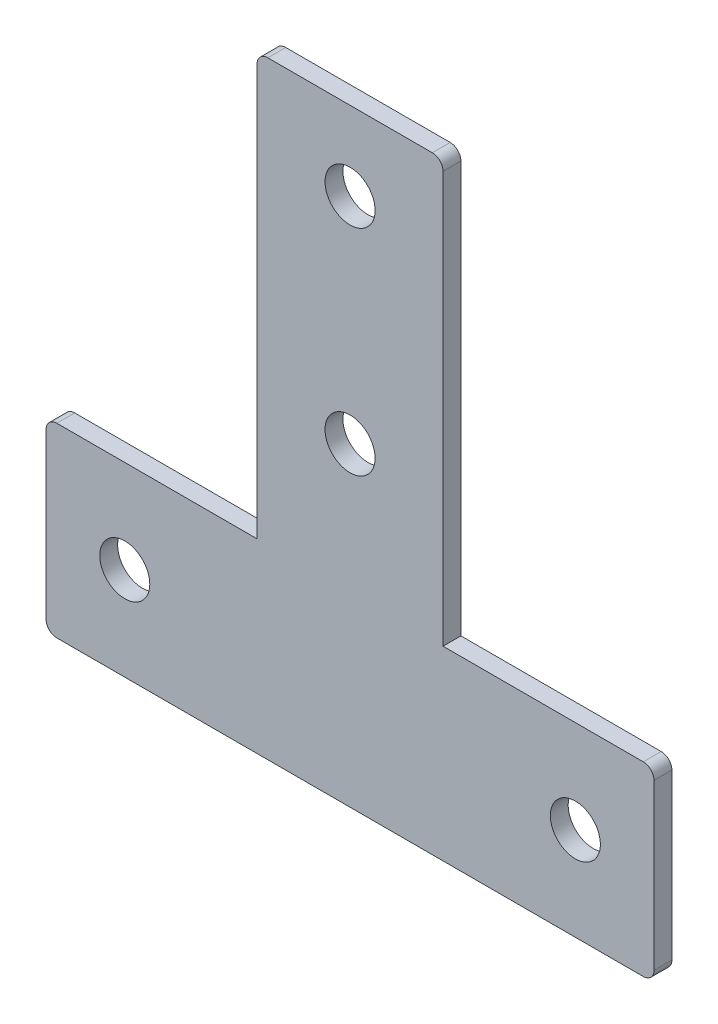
ISO-10303-21;
HEADER;
FILE_DESCRIPTION(('STEP AP214'),'2;1');
FILE_NAME('part.step','',(''),(''),'','','');
FILE_SCHEMA(('AUTOMOTIVE_DESIGN { 1 0 10303 214 1 1 1 1 }'));
ENDSEC;
DATA;
#1=APPLICATION_CONTEXT('core data for automotive mechanical design processes');
#2=APPLICATION_PROTOCOL_DEFINITION('international standard','automotive_design',2000,#1);
#3=PRODUCT_CONTEXT('',#1,'mechanical');
#4=PRODUCT('Part','Part','',(#3));
#5=PRODUCT_RELATED_PRODUCT_CATEGORY('part','',(#4));
#6=PRODUCT_DEFINITION_FORMATION('','',#4);
#7=PRODUCT_DEFINITION_CONTEXT('part definition',#1,'design');
#8=PRODUCT_DEFINITION('design','',#6,#7);
#9=PRODUCT_DEFINITION_SHAPE('','',#8);
#10=(LENGTH_UNIT() NAMED_UNIT(*) SI_UNIT(.MILLI.,.METRE.));
#11=(NAMED_UNIT(*) PLANE_ANGLE_UNIT() SI_UNIT($,.RADIAN.));
#12=(NAMED_UNIT(*) SI_UNIT($,.STERADIAN.) SOLID_ANGLE_UNIT());
#13=UNCERTAINTY_MEASURE_WITH_UNIT(LENGTH_MEASURE(1.E-05),#10,'distance_accuracy_value','');
#14=(GEOMETRIC_REPRESENTATION_CONTEXT(3) GLOBAL_UNCERTAINTY_ASSIGNED_CONTEXT((#13)) GLOBAL_UNIT_ASSIGNED_CONTEXT((#10,
#11,#12)) REPRESENTATION_CONTEXT('',''));
#15=CARTESIAN_POINT('',(0.,0.,0.));
#16=DIRECTION('',(0.,0.,1.));
#17=DIRECTION('',(1.,0.,0.));
#18=AXIS2_PLACEMENT_3D('',#15,#16,#17);
#19=CARTESIAN_POINT('',(0.,0.,1.25));
#20=DIRECTION('',(0.,0.,-1.));
#21=DIRECTION('',(-1.,0.,0.));
#22=AXIS2_PLACEMENT_3D('',#19,#20,#21);
#23=PLANE('',#22);
#24=CARTESIAN_POINT('',(-31.5,13.,1.25));
#25=DIRECTION('',(0.,0.,1.));
#26=DIRECTION('',(1.,0.,0.));
#27=AXIS2_PLACEMENT_3D('',#24,#25,#26);
#28=CIRCLE('',#27,3.5);
#29=CARTESIAN_POINT('',(-28.,13.,1.25));
#30=VERTEX_POINT('',#29);
#31=EDGE_CURVE('E272',#30,#30,#28,.T.);
#32=ORIENTED_EDGE('',*,*,#31,.F.);
#33=EDGE_LOOP('',(#32));
#34=FACE_BOUND('',#33,.T.);
#35=CARTESIAN_POINT('',(0.,74.,1.25));
#36=DIRECTION('',(0.,0.,1.));
#37=DIRECTION('',(1.,0.,0.));
#38=AXIS2_PLACEMENT_3D('',#35,#36,#37);
#39=CIRCLE('',#38,3.5);
#40=CARTESIAN_POINT('',(3.5,74.,1.25));
#41=VERTEX_POINT('',#40);
#42=EDGE_CURVE('E178',#41,#41,#39,.T.);
#43=ORIENTED_EDGE('',*,*,#42,.F.);
#44=EDGE_LOOP('',(#43));
#45=FACE_BOUND('',#44,.T.);
#46=DIRECTION('',(0.,1.,0.));
#47=VECTOR('',#46,1.);
#48=CARTESIAN_POINT('',(13.,85.,1.25));
#49=LINE('',#48,#47);
#50=CARTESIAN_POINT('',(13.,26.,1.25));
#51=VERTEX_POINT('',#50);
#52=CARTESIAN_POINT('',(13.,83.5,1.25));
#53=VERTEX_POINT('',#52);
#54=EDGE_CURVE('E138',#51,#53,#49,.T.);
#55=ORIENTED_EDGE('',*,*,#54,.T.);
#56=CARTESIAN_POINT('',(11.5,83.5,1.25));
#57=DIRECTION('',(0.,0.,-1.));
#58=DIRECTION('',(-1.,0.,0.));
#59=AXIS2_PLACEMENT_3D('',#56,#57,#58);
#60=CIRCLE('',#59,1.5);
#61=CARTESIAN_POINT('',(11.5,85.,1.25));
#62=VERTEX_POINT('',#61);
#63=EDGE_CURVE('E222',#53,#62,#60,.F.);
#64=ORIENTED_EDGE('',*,*,#63,.T.);
#65=DIRECTION('',(-1.,0.,0.));
#66=VECTOR('',#65,1.);
#67=CARTESIAN_POINT('',(-13.,85.,1.25));
#68=LINE('',#67,#66);
#69=CARTESIAN_POINT('',(-11.5,85.,1.25));
#70=VERTEX_POINT('',#69);
#71=EDGE_CURVE('E162',#62,#70,#68,.T.);
#72=ORIENTED_EDGE('',*,*,#71,.T.);
#73=CARTESIAN_POINT('',(-11.5,83.5,1.25));
#74=DIRECTION('',(0.,0.,-1.));
#75=DIRECTION('',(-1.,0.,0.));
#76=AXIS2_PLACEMENT_3D('',#73,#74,#75);
#77=CIRCLE('',#76,1.5);
#78=CARTESIAN_POINT('',(-13.,83.5,1.25));
#79=VERTEX_POINT('',#78);
#80=EDGE_CURVE('E220',#70,#79,#77,.F.);
#81=ORIENTED_EDGE('',*,*,#80,.T.);
#82=DIRECTION('',(0.,-1.,0.));
#83=VECTOR('',#82,1.);
#84=CARTESIAN_POINT('',(-13.,26.,1.25));
#85=LINE('',#84,#83);
#86=CARTESIAN_POINT('',(-13.,26.,1.25));
#87=VERTEX_POINT('',#86);
#88=EDGE_CURVE('E165',#79,#87,#85,.T.);
#89=ORIENTED_EDGE('',*,*,#88,.T.);
#90=DIRECTION('',(-1.,0.,0.));
#91=VECTOR('',#90,1.);
#92=CARTESIAN_POINT('',(-42.5,26.,1.25));
#93=LINE('',#92,#91);
#94=CARTESIAN_POINT('',(-41.,26.,1.25));
#95=VERTEX_POINT('',#94);
#96=EDGE_CURVE('E170',#87,#95,#93,.T.);
#97=ORIENTED_EDGE('',*,*,#96,.T.);
#98=CARTESIAN_POINT('',(-41.,24.5,1.25));
#99=DIRECTION('',(0.,0.,-1.));
#100=DIRECTION('',(-1.,0.,0.));
#101=AXIS2_PLACEMENT_3D('',#98,#99,#100);
#102=CIRCLE('',#101,1.5);
#103=CARTESIAN_POINT('',(-42.5,24.5,1.25));
#104=VERTEX_POINT('',#103);
#105=EDGE_CURVE('E55',#95,#104,#102,.F.);
#106=ORIENTED_EDGE('',*,*,#105,.T.);
#107=DIRECTION('',(0.,-1.,0.));
#108=VECTOR('',#107,1.);
#109=CARTESIAN_POINT('',(-42.5,0.,1.25));
#110=LINE('',#109,#108);
#111=CARTESIAN_POINT('',(-42.5,1.5,1.25));
#112=VERTEX_POINT('',#111);
#113=EDGE_CURVE('E172',#104,#112,#110,.T.);
#114=ORIENTED_EDGE('',*,*,#113,.T.);
#115=CARTESIAN_POINT('',(-41.,1.5,1.25));
#116=DIRECTION('',(0.,0.,-1.));
#117=DIRECTION('',(-1.,0.,0.));
#118=AXIS2_PLACEMENT_3D('',#115,#116,#117);
#119=CIRCLE('',#118,1.5);
#120=CARTESIAN_POINT('',(-41.,0.,1.25));
#121=VERTEX_POINT('',#120);
#122=EDGE_CURVE('E215',#112,#121,#119,.F.);
#123=ORIENTED_EDGE('',*,*,#122,.T.);
#124=DIRECTION('',(1.,0.,0.));
#125=VECTOR('',#124,1.);
#126=CARTESIAN_POINT('',(42.5,0.,1.25));
#127=LINE('',#126,#125);
#128=CARTESIAN_POINT('',(41.,0.,1.25));
#129=VERTEX_POINT('',#128);
#130=EDGE_CURVE('E194',#121,#129,#127,.T.);
#131=ORIENTED_EDGE('',*,*,#130,.T.);
#132=CARTESIAN_POINT('',(41.,1.50000000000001,1.25));
#133=DIRECTION('',(0.,0.,-1.));
#134=DIRECTION('',(-1.,0.,0.));
#135=AXIS2_PLACEMENT_3D('',#132,#133,#134);
#136=CIRCLE('',#135,1.5);
#137=CARTESIAN_POINT('',(42.5,1.50000000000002,1.25));
#138=VERTEX_POINT('',#137);
#139=EDGE_CURVE('E217',#129,#138,#136,.F.);
#140=ORIENTED_EDGE('',*,*,#139,.T.);
#141=DIRECTION('',(0.,1.,0.));
#142=VECTOR('',#141,1.);
#143=CARTESIAN_POINT('',(42.5,26.,1.25));
#144=LINE('',#143,#142);
#145=CARTESIAN_POINT('',(42.5,24.5,1.25));
#146=VERTEX_POINT('',#145);
#147=EDGE_CURVE('E146',#138,#146,#144,.T.);
#148=ORIENTED_EDGE('',*,*,#147,.T.);
#149=CARTESIAN_POINT('',(41.,24.5,1.25));
#150=DIRECTION('',(0.,0.,-1.));
#151=DIRECTION('',(-1.,0.,0.));
#152=AXIS2_PLACEMENT_3D('',#149,#150,#151);
#153=CIRCLE('',#152,1.5);
#154=CARTESIAN_POINT('',(41.,26.,1.25));
#155=VERTEX_POINT('',#154);
#156=EDGE_CURVE('E142',#146,#155,#153,.F.);
#157=ORIENTED_EDGE('',*,*,#156,.T.);
#158=DIRECTION('',(-1.,0.,0.));
#159=VECTOR('',#158,1.);
#160=CARTESIAN_POINT('',(13.,26.,1.25));
#161=LINE('',#160,#159);
#162=EDGE_CURVE('E134',#155,#51,#161,.T.);
#163=ORIENTED_EDGE('',*,*,#162,.T.);
#164=EDGE_LOOP('',(#55,#64,#72,#81,#89,#97,#106,#114,#123,#131,#140,#148,#157,#163));
#165=FACE_BOUND('',#164,.T.);
#166=CARTESIAN_POINT('',(0.,44.,1.25));
#167=DIRECTION('',(0.,0.,1.));
#168=DIRECTION('',(1.,0.,0.));
#169=AXIS2_PLACEMENT_3D('',#166,#167,#168);
#170=CIRCLE('',#169,3.5);
#171=CARTESIAN_POINT('',(3.5,44.,1.25));
#172=VERTEX_POINT('',#171);
#173=EDGE_CURVE('E266',#172,#172,#170,.T.);
#174=ORIENTED_EDGE('',*,*,#173,.F.);
#175=EDGE_LOOP('',(#174));
#176=FACE_BOUND('',#175,.T.);
#177=CARTESIAN_POINT('',(31.5,13.,1.25));
#178=DIRECTION('',(0.,0.,1.));
#179=DIRECTION('',(1.,0.,0.));
#180=AXIS2_PLACEMENT_3D('',#177,#178,#179);
#181=CIRCLE('',#180,3.5);
#182=CARTESIAN_POINT('',(35.,13.,1.25));
#183=VERTEX_POINT('',#182);
#184=EDGE_CURVE('E278',#183,#183,#181,.T.);
#185=ORIENTED_EDGE('',*,*,#184,.F.);
#186=EDGE_LOOP('',(#185));
#187=FACE_BOUND('',#186,.T.);
#188=ADVANCED_FACE('F34',(#34,#45,#165,#176,#187),#23,.F.);
#189=CARTESIAN_POINT('',(0.,0.,-1.25));
#190=DIRECTION('',(0.,0.,-1.));
#191=DIRECTION('',(-1.,0.,0.));
#192=AXIS2_PLACEMENT_3D('',#189,#190,#191);
#193=PLANE('',#192);
#194=CARTESIAN_POINT('',(-31.5,13.,-1.25));
#195=DIRECTION('',(0.,0.,1.));
#196=DIRECTION('',(1.,0.,0.));
#197=AXIS2_PLACEMENT_3D('',#194,#195,#196);
#198=CIRCLE('',#197,3.5);
#199=CARTESIAN_POINT('',(-28.,13.,-1.25));
#200=VERTEX_POINT('',#199);
#201=EDGE_CURVE('E275',#200,#200,#198,.T.);
#202=ORIENTED_EDGE('',*,*,#201,.T.);
#203=EDGE_LOOP('',(#202));
#204=FACE_BOUND('',#203,.T.);
#205=CARTESIAN_POINT('',(0.,74.,-1.25));
#206=DIRECTION('',(0.,0.,1.));
#207=DIRECTION('',(1.,0.,0.));
#208=AXIS2_PLACEMENT_3D('',#205,#206,#207);
#209=CIRCLE('',#208,3.5);
#210=CARTESIAN_POINT('',(3.5,74.,-1.25));
#211=VERTEX_POINT('',#210);
#212=EDGE_CURVE('E263',#211,#211,#209,.T.);
#213=ORIENTED_EDGE('',*,*,#212,.T.);
#214=EDGE_LOOP('',(#213));
#215=FACE_BOUND('',#214,.T.);
#216=DIRECTION('',(-1.,0.,0.));
#217=VECTOR('',#216,1.);
#218=CARTESIAN_POINT('',(-13.,85.,-1.25));
#219=LINE('',#218,#217);
#220=CARTESIAN_POINT('',(11.5,85.,-1.25));
#221=VERTEX_POINT('',#220);
#222=CARTESIAN_POINT('',(-11.5,85.,-1.25));
#223=VERTEX_POINT('',#222);
#224=EDGE_CURVE('E184',#221,#223,#219,.T.);
#225=ORIENTED_EDGE('',*,*,#224,.F.);
#226=CARTESIAN_POINT('',(11.5,83.5,-1.25));
#227=DIRECTION('',(0.,0.,-1.));
#228=DIRECTION('',(-1.,0.,0.));
#229=AXIS2_PLACEMENT_3D('',#226,#227,#228);
#230=CIRCLE('',#229,1.5);
#231=CARTESIAN_POINT('',(13.,83.5,-1.25));
#232=VERTEX_POINT('',#231);
#233=EDGE_CURVE('E211',#221,#232,#230,.T.);
#234=ORIENTED_EDGE('',*,*,#233,.T.);
#235=DIRECTION('',(0.,1.,0.));
#236=VECTOR('',#235,1.);
#237=CARTESIAN_POINT('',(13.,85.,-1.25));
#238=LINE('',#237,#236);
#239=CARTESIAN_POINT('',(13.,26.,-1.25));
#240=VERTEX_POINT('',#239);
#241=EDGE_CURVE('E182',#240,#232,#238,.T.);
#242=ORIENTED_EDGE('',*,*,#241,.F.);
#243=DIRECTION('',(-1.,0.,0.));
#244=VECTOR('',#243,1.);
#245=CARTESIAN_POINT('',(13.,26.,-1.25));
#246=LINE('',#245,#244);
#247=CARTESIAN_POINT('',(41.,26.,-1.25));
#248=VERTEX_POINT('',#247);
#249=EDGE_CURVE('E152',#248,#240,#246,.T.);
#250=ORIENTED_EDGE('',*,*,#249,.F.);
#251=CARTESIAN_POINT('',(41.,24.5,-1.25));
#252=DIRECTION('',(0.,0.,-1.));
#253=DIRECTION('',(-1.,0.,0.));
#254=AXIS2_PLACEMENT_3D('',#251,#252,#253);
#255=CIRCLE('',#254,1.5);
#256=CARTESIAN_POINT('',(42.5,24.5,-1.25));
#257=VERTEX_POINT('',#256);
#258=EDGE_CURVE('E207',#248,#257,#255,.T.);
#259=ORIENTED_EDGE('',*,*,#258,.T.);
#260=DIRECTION('',(0.,1.,0.));
#261=VECTOR('',#260,1.);
#262=CARTESIAN_POINT('',(42.5,26.,-1.25));
#263=LINE('',#262,#261);
#264=CARTESIAN_POINT('',(42.5,1.50000000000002,-1.25));
#265=VERTEX_POINT('',#264);
#266=EDGE_CURVE('E177',#265,#257,#263,.T.);
#267=ORIENTED_EDGE('',*,*,#266,.F.);
#268=CARTESIAN_POINT('',(41.,1.50000000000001,-1.25));
#269=DIRECTION('',(0.,0.,-1.));
#270=DIRECTION('',(-1.,0.,0.));
#271=AXIS2_PLACEMENT_3D('',#268,#269,#270);
#272=CIRCLE('',#271,1.5);
#273=CARTESIAN_POINT('',(41.,0.,-1.25));
#274=VERTEX_POINT('',#273);
#275=EDGE_CURVE('E205',#265,#274,#272,.T.);
#276=ORIENTED_EDGE('',*,*,#275,.T.);
#277=DIRECTION('',(1.,0.,0.));
#278=VECTOR('',#277,1.);
#279=CARTESIAN_POINT('',(42.5,0.,-1.25));
#280=LINE('',#279,#278);
#281=CARTESIAN_POINT('',(-41.,0.,-1.25));
#282=VERTEX_POINT('',#281);
#283=EDGE_CURVE('E174',#282,#274,#280,.T.);
#284=ORIENTED_EDGE('',*,*,#283,.F.);
#285=CARTESIAN_POINT('',(-41.,1.5,-1.25));
#286=DIRECTION('',(0.,0.,-1.));
#287=DIRECTION('',(-1.,0.,0.));
#288=AXIS2_PLACEMENT_3D('',#285,#286,#287);
#289=CIRCLE('',#288,1.5);
#290=CARTESIAN_POINT('',(-42.5,1.5,-1.25));
#291=VERTEX_POINT('',#290);
#292=EDGE_CURVE('E203',#282,#291,#289,.T.);
#293=ORIENTED_EDGE('',*,*,#292,.T.);
#294=DIRECTION('',(0.,-1.,0.));
#295=VECTOR('',#294,1.);
#296=CARTESIAN_POINT('',(-42.5,0.,-1.25));
#297=LINE('',#296,#295);
#298=CARTESIAN_POINT('',(-42.5,24.5,-1.25));
#299=VERTEX_POINT('',#298);
#300=EDGE_CURVE('E192',#299,#291,#297,.T.);
#301=ORIENTED_EDGE('',*,*,#300,.F.);
#302=CARTESIAN_POINT('',(-41.,24.5,-1.25));
#303=DIRECTION('',(0.,0.,-1.));
#304=DIRECTION('',(-1.,0.,0.));
#305=AXIS2_PLACEMENT_3D('',#302,#303,#304);
#306=CIRCLE('',#305,1.5);
#307=CARTESIAN_POINT('',(-41.,26.,-1.25));
#308=VERTEX_POINT('',#307);
#309=EDGE_CURVE('E201',#299,#308,#306,.T.);
#310=ORIENTED_EDGE('',*,*,#309,.T.);
#311=DIRECTION('',(-1.,0.,0.));
#312=VECTOR('',#311,1.);
#313=CARTESIAN_POINT('',(-42.5,26.,-1.25));
#314=LINE('',#313,#312);
#315=CARTESIAN_POINT('',(-13.,26.,-1.25));
#316=VERTEX_POINT('',#315);
#317=EDGE_CURVE('E189',#316,#308,#314,.T.);
#318=ORIENTED_EDGE('',*,*,#317,.F.);
#319=DIRECTION('',(0.,-1.,0.));
#320=VECTOR('',#319,1.);
#321=CARTESIAN_POINT('',(-13.,26.,-1.25));
#322=LINE('',#321,#320);
#323=CARTESIAN_POINT('',(-13.,83.5,-1.25));
#324=VERTEX_POINT('',#323);
#325=EDGE_CURVE('E187',#324,#316,#322,.T.);
#326=ORIENTED_EDGE('',*,*,#325,.F.);
#327=CARTESIAN_POINT('',(-11.5,83.5,-1.25));
#328=DIRECTION('',(0.,0.,-1.));
#329=DIRECTION('',(-1.,0.,0.));
#330=AXIS2_PLACEMENT_3D('',#327,#328,#329);
#331=CIRCLE('',#330,1.5);
#332=EDGE_CURVE('E209',#324,#223,#331,.T.);
#333=ORIENTED_EDGE('',*,*,#332,.T.);
#334=EDGE_LOOP('',(#225,#234,#242,#250,#259,#267,#276,#284,#293,#301,#310,#318,#326,#333));
#335=FACE_BOUND('',#334,.T.);
#336=CARTESIAN_POINT('',(0.,44.,-1.25));
#337=DIRECTION('',(0.,0.,1.));
#338=DIRECTION('',(1.,0.,0.));
#339=AXIS2_PLACEMENT_3D('',#336,#337,#338);
#340=CIRCLE('',#339,3.5);
#341=CARTESIAN_POINT('',(3.5,44.,-1.25));
#342=VERTEX_POINT('',#341);
#343=EDGE_CURVE('E269',#342,#342,#340,.T.);
#344=ORIENTED_EDGE('',*,*,#343,.T.);
#345=EDGE_LOOP('',(#344));
#346=FACE_BOUND('',#345,.T.);
#347=CARTESIAN_POINT('',(31.5,13.,-1.25));
#348=DIRECTION('',(0.,0.,1.));
#349=DIRECTION('',(1.,0.,0.));
#350=AXIS2_PLACEMENT_3D('',#347,#348,#349);
#351=CIRCLE('',#350,3.5);
#352=CARTESIAN_POINT('',(35.,13.,-1.25));
#353=VERTEX_POINT('',#352);
#354=EDGE_CURVE('E281',#353,#353,#351,.T.);
#355=ORIENTED_EDGE('',*,*,#354,.T.);
#356=EDGE_LOOP('',(#355));
#357=FACE_BOUND('',#356,.T.);
#358=ADVANCED_FACE('F247',(#204,#215,#335,#346,#357),#193,.T.);
#359=CARTESIAN_POINT('',(42.5,0.,1.25));
#360=DIRECTION('',(0.,1.,0.));
#361=DIRECTION('',(-1.,0.,0.));
#362=AXIS2_PLACEMENT_3D('',#359,#360,#361);
#363=PLANE('',#362);
#364=ORIENTED_EDGE('',*,*,#283,.T.);
#365=DIRECTION('',(0.,0.,-1.));
#366=VECTOR('',#365,1.);
#367=CARTESIAN_POINT('',(41.,0.,1.25));
#368=LINE('',#367,#366);
#369=EDGE_CURVE('E237',#274,#129,#368,.F.);
#370=ORIENTED_EDGE('',*,*,#369,.T.);
#371=ORIENTED_EDGE('',*,*,#130,.F.);
#372=DIRECTION('',(0.,0.,-1.));
#373=VECTOR('',#372,1.);
#374=CARTESIAN_POINT('',(-41.,0.,1.25));
#375=LINE('',#374,#373);
#376=EDGE_CURVE('E234',#121,#282,#375,.T.);
#377=ORIENTED_EDGE('',*,*,#376,.T.);
#378=EDGE_LOOP('',(#364,#370,#371,#377));
#379=FACE_BOUND('',#378,.T.);
#380=ADVANCED_FACE('F257',(#379),#363,.F.);
#381=CARTESIAN_POINT('',(42.5,26.,1.25));
#382=DIRECTION('',(-1.,0.,0.));
#383=DIRECTION('',(0.,0.,1.));
#384=AXIS2_PLACEMENT_3D('',#381,#382,#383);
#385=PLANE('',#384);
#386=ORIENTED_EDGE('',*,*,#266,.T.);
#387=DIRECTION('',(0.,0.,-1.));
#388=VECTOR('',#387,1.);
#389=CARTESIAN_POINT('',(42.5,24.5,1.25));
#390=LINE('',#389,#388);
#391=EDGE_CURVE('E232',#257,#146,#390,.F.);
#392=ORIENTED_EDGE('',*,*,#391,.T.);
#393=ORIENTED_EDGE('',*,*,#147,.F.);
#394=DIRECTION('',(0.,0.,-1.));
#395=VECTOR('',#394,1.);
#396=CARTESIAN_POINT('',(42.5,1.50000000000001,1.25));
#397=LINE('',#396,#395);
#398=EDGE_CURVE('E229',#138,#265,#397,.T.);
#399=ORIENTED_EDGE('',*,*,#398,.T.);
#400=EDGE_LOOP('',(#386,#392,#393,#399));
#401=FACE_BOUND('',#400,.T.);
#402=ADVANCED_FACE('F323',(#401),#385,.F.);
#403=CARTESIAN_POINT('',(13.,26.,1.25));
#404=DIRECTION('',(0.,-1.,0.));
#405=DIRECTION('',(0.,0.,-1.));
#406=AXIS2_PLACEMENT_3D('',#403,#404,#405);
#407=PLANE('',#406);
#408=ORIENTED_EDGE('',*,*,#162,.F.);
#409=DIRECTION('',(0.,0.,-1.));
#410=VECTOR('',#409,1.);
#411=CARTESIAN_POINT('',(41.,26.,1.25));
#412=LINE('',#411,#410);
#413=EDGE_CURVE('E227',#155,#248,#412,.T.);
#414=ORIENTED_EDGE('',*,*,#413,.T.);
#415=ORIENTED_EDGE('',*,*,#249,.T.);
#416=DIRECTION('',(0.,0.,-1.));
#417=VECTOR('',#416,1.);
#418=CARTESIAN_POINT('',(13.,26.,1.25));
#419=LINE('',#418,#417);
#420=EDGE_CURVE('E149',#51,#240,#419,.T.);
#421=ORIENTED_EDGE('',*,*,#420,.F.);
#422=EDGE_LOOP('',(#408,#414,#415,#421));
#423=FACE_BOUND('',#422,.T.);
#424=ADVANCED_FACE('F150',(#423),#407,.F.);
#425=CARTESIAN_POINT('',(13.,85.,1.25));
#426=DIRECTION('',(-1.,0.,0.));
#427=DIRECTION('',(0.,-1.,0.));
#428=AXIS2_PLACEMENT_3D('',#425,#426,#427);
#429=PLANE('',#428);
#430=ORIENTED_EDGE('',*,*,#241,.T.);
#431=DIRECTION('',(0.,0.,-1.));
#432=VECTOR('',#431,1.);
#433=CARTESIAN_POINT('',(13.,83.5,1.25));
#434=LINE('',#433,#432);
#435=EDGE_CURVE('E161',#232,#53,#434,.F.);
#436=ORIENTED_EDGE('',*,*,#435,.T.);
#437=ORIENTED_EDGE('',*,*,#54,.F.);
#438=ORIENTED_EDGE('',*,*,#420,.T.);
#439=EDGE_LOOP('',(#430,#436,#437,#438));
#440=FACE_BOUND('',#439,.T.);
#441=ADVANCED_FACE('F159',(#440),#429,.F.);
#442=CARTESIAN_POINT('',(-13.,85.,1.25));
#443=DIRECTION('',(0.,-1.,0.));
#444=DIRECTION('',(0.,0.,-1.));
#445=AXIS2_PLACEMENT_3D('',#442,#443,#444);
#446=PLANE('',#445);
#447=ORIENTED_EDGE('',*,*,#71,.F.);
#448=DIRECTION('',(0.,0.,-1.));
#449=VECTOR('',#448,1.);
#450=CARTESIAN_POINT('',(11.5,85.,1.25));
#451=LINE('',#450,#449);
#452=EDGE_CURVE('E198',#62,#221,#451,.T.);
#453=ORIENTED_EDGE('',*,*,#452,.T.);
#454=ORIENTED_EDGE('',*,*,#224,.T.);
#455=DIRECTION('',(0.,0.,-1.));
#456=VECTOR('',#455,1.);
#457=CARTESIAN_POINT('',(-11.5,85.,1.25));
#458=LINE('',#457,#456);
#459=EDGE_CURVE('E156',#223,#70,#458,.F.);
#460=ORIENTED_EDGE('',*,*,#459,.T.);
#461=EDGE_LOOP('',(#447,#453,#454,#460));
#462=FACE_BOUND('',#461,.T.);
#463=ADVANCED_FACE('F314',(#462),#446,.F.);
#464=CARTESIAN_POINT('',(-13.,26.,1.25));
#465=DIRECTION('',(1.,0.,0.));
#466=DIRECTION('',(0.,0.,-1.));
#467=AXIS2_PLACEMENT_3D('',#464,#465,#466);
#468=PLANE('',#467);
#469=ORIENTED_EDGE('',*,*,#88,.F.);
#470=DIRECTION('',(0.,0.,-1.));
#471=VECTOR('',#470,1.);
#472=CARTESIAN_POINT('',(-13.,83.5,1.25));
#473=LINE('',#472,#471);
#474=EDGE_CURVE('E224',#79,#324,#473,.T.);
#475=ORIENTED_EDGE('',*,*,#474,.T.);
#476=ORIENTED_EDGE('',*,*,#325,.T.);
#477=DIRECTION('',(0.,0.,-1.));
#478=VECTOR('',#477,1.);
#479=CARTESIAN_POINT('',(-13.,26.,1.25));
#480=LINE('',#479,#478);
#481=EDGE_CURVE('E157',#87,#316,#480,.T.);
#482=ORIENTED_EDGE('',*,*,#481,.F.);
#483=EDGE_LOOP('',(#469,#475,#476,#482));
#484=FACE_BOUND('',#483,.T.);
#485=ADVANCED_FACE('F310',(#484),#468,.F.);
#486=CARTESIAN_POINT('',(-42.5,26.,1.25));
#487=DIRECTION('',(0.,-1.,0.));
#488=DIRECTION('',(0.,0.,-1.));
#489=AXIS2_PLACEMENT_3D('',#486,#487,#488);
#490=PLANE('',#489);
#491=ORIENTED_EDGE('',*,*,#317,.T.);
#492=DIRECTION('',(0.,0.,-1.));
#493=VECTOR('',#492,1.);
#494=CARTESIAN_POINT('',(-41.,26.,1.25));
#495=LINE('',#494,#493);
#496=EDGE_CURVE('E11',#308,#95,#495,.F.);
#497=ORIENTED_EDGE('',*,*,#496,.T.);
#498=ORIENTED_EDGE('',*,*,#96,.F.);
#499=ORIENTED_EDGE('',*,*,#481,.T.);
#500=EDGE_LOOP('',(#491,#497,#498,#499));
#501=FACE_BOUND('',#500,.T.);
#502=ADVANCED_FACE('F307',(#501),#490,.F.);
#503=CARTESIAN_POINT('',(-42.5,0.,1.25));
#504=DIRECTION('',(1.,0.,0.));
#505=DIRECTION('',(0.,0.,-1.));
#506=AXIS2_PLACEMENT_3D('',#503,#504,#505);
#507=PLANE('',#506);
#508=ORIENTED_EDGE('',*,*,#300,.T.);
#509=DIRECTION('',(0.,0.,-1.));
#510=VECTOR('',#509,1.);
#511=CARTESIAN_POINT('',(-42.5,1.5,1.25));
#512=LINE('',#511,#510);
#513=EDGE_CURVE('E42',#291,#112,#512,.F.);
#514=ORIENTED_EDGE('',*,*,#513,.T.);
#515=ORIENTED_EDGE('',*,*,#113,.F.);
#516=DIRECTION('',(0.,0.,-1.));
#517=VECTOR('',#516,1.);
#518=CARTESIAN_POINT('',(-42.5,24.5,1.25));
#519=LINE('',#518,#517);
#520=EDGE_CURVE('E239',#104,#299,#519,.T.);
#521=ORIENTED_EDGE('',*,*,#520,.T.);
#522=EDGE_LOOP('',(#508,#514,#515,#521));
#523=FACE_BOUND('',#522,.T.);
#524=ADVANCED_FACE('F243',(#523),#507,.F.);
#525=CARTESIAN_POINT('',(0.,74.,1.25));
#526=DIRECTION('',(0.,0.,-1.));
#527=DIRECTION('',(-1.,0.,0.));
#528=AXIS2_PLACEMENT_3D('',#525,#526,#527);
#529=CYLINDRICAL_SURFACE('',#528,3.5);
#530=ORIENTED_EDGE('',*,*,#42,.T.);
#531=EDGE_LOOP('',(#530));
#532=FACE_BOUND('',#531,.T.);
#533=ORIENTED_EDGE('',*,*,#212,.F.);
#534=EDGE_LOOP('',(#533));
#535=FACE_BOUND('',#534,.T.);
#536=ADVANCED_FACE('F302',(#532,#535),#529,.F.);
#537=CARTESIAN_POINT('',(0.,44.,1.25));
#538=DIRECTION('',(0.,0.,-1.));
#539=DIRECTION('',(-1.,0.,0.));
#540=AXIS2_PLACEMENT_3D('',#537,#538,#539);
#541=CYLINDRICAL_SURFACE('',#540,3.5);
#542=ORIENTED_EDGE('',*,*,#173,.T.);
#543=EDGE_LOOP('',(#542));
#544=FACE_BOUND('',#543,.T.);
#545=ORIENTED_EDGE('',*,*,#343,.F.);
#546=EDGE_LOOP('',(#545));
#547=FACE_BOUND('',#546,.T.);
#548=ADVANCED_FACE('F462',(#544,#547),#541,.F.);
#549=CARTESIAN_POINT('',(-31.5,13.,1.25));
#550=DIRECTION('',(0.,0.,-1.));
#551=DIRECTION('',(-1.,0.,0.));
#552=AXIS2_PLACEMENT_3D('',#549,#550,#551);
#553=CYLINDRICAL_SURFACE('',#552,3.5);
#554=ORIENTED_EDGE('',*,*,#31,.T.);
#555=EDGE_LOOP('',(#554));
#556=FACE_BOUND('',#555,.T.);
#557=ORIENTED_EDGE('',*,*,#201,.F.);
#558=EDGE_LOOP('',(#557));
#559=FACE_BOUND('',#558,.T.);
#560=ADVANCED_FACE('F470',(#556,#559),#553,.F.);
#561=CARTESIAN_POINT('',(31.5,13.,1.25));
#562=DIRECTION('',(0.,0.,-1.));
#563=DIRECTION('',(-1.,0.,0.));
#564=AXIS2_PLACEMENT_3D('',#561,#562,#563);
#565=CYLINDRICAL_SURFACE('',#564,3.5);
#566=ORIENTED_EDGE('',*,*,#184,.T.);
#567=EDGE_LOOP('',(#566));
#568=FACE_BOUND('',#567,.T.);
#569=ORIENTED_EDGE('',*,*,#354,.F.);
#570=EDGE_LOOP('',(#569));
#571=FACE_BOUND('',#570,.T.);
#572=ADVANCED_FACE('F287',(#568,#571),#565,.F.);
#573=CARTESIAN_POINT('',(11.5,83.5,1.25));
#574=DIRECTION('',(0.,0.,-1.));
#575=DIRECTION('',(-1.,0.,0.));
#576=AXIS2_PLACEMENT_3D('',#573,#574,#575);
#577=CYLINDRICAL_SURFACE('',#576,1.5);
#578=ORIENTED_EDGE('',*,*,#63,.F.);
#579=ORIENTED_EDGE('',*,*,#435,.F.);
#580=ORIENTED_EDGE('',*,*,#233,.F.);
#581=ORIENTED_EDGE('',*,*,#452,.F.);
#582=EDGE_LOOP('',(#578,#579,#580,#581));
#583=FACE_BOUND('',#582,.T.);
#584=ADVANCED_FACE('F329',(#583),#577,.T.);
#585=CARTESIAN_POINT('',(-11.5,83.5,1.25));
#586=DIRECTION('',(0.,0.,-1.));
#587=DIRECTION('',(-1.,0.,0.));
#588=AXIS2_PLACEMENT_3D('',#585,#586,#587);
#589=CYLINDRICAL_SURFACE('',#588,1.5);
#590=ORIENTED_EDGE('',*,*,#80,.F.);
#591=ORIENTED_EDGE('',*,*,#459,.F.);
#592=ORIENTED_EDGE('',*,*,#332,.F.);
#593=ORIENTED_EDGE('',*,*,#474,.F.);
#594=EDGE_LOOP('',(#590,#591,#592,#593));
#595=FACE_BOUND('',#594,.T.);
#596=ADVANCED_FACE('F332',(#595),#589,.T.);
#597=CARTESIAN_POINT('',(41.,24.5,1.25));
#598=DIRECTION('',(0.,0.,-1.));
#599=DIRECTION('',(-1.,0.,0.));
#600=AXIS2_PLACEMENT_3D('',#597,#598,#599);
#601=CYLINDRICAL_SURFACE('',#600,1.5);
#602=ORIENTED_EDGE('',*,*,#156,.F.);
#603=ORIENTED_EDGE('',*,*,#391,.F.);
#604=ORIENTED_EDGE('',*,*,#258,.F.);
#605=ORIENTED_EDGE('',*,*,#413,.F.);
#606=EDGE_LOOP('',(#602,#603,#604,#605));
#607=FACE_BOUND('',#606,.T.);
#608=ADVANCED_FACE('F336',(#607),#601,.T.);
#609=CARTESIAN_POINT('',(41.,1.50000000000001,1.25));
#610=DIRECTION('',(0.,0.,-1.));
#611=DIRECTION('',(-1.,0.,0.));
#612=AXIS2_PLACEMENT_3D('',#609,#610,#611);
#613=CYLINDRICAL_SURFACE('',#612,1.5);
#614=ORIENTED_EDGE('',*,*,#139,.F.);
#615=ORIENTED_EDGE('',*,*,#369,.F.);
#616=ORIENTED_EDGE('',*,*,#275,.F.);
#617=ORIENTED_EDGE('',*,*,#398,.F.);
#618=EDGE_LOOP('',(#614,#615,#616,#617));
#619=FACE_BOUND('',#618,.T.);
#620=ADVANCED_FACE('F340',(#619),#613,.T.);
#621=CARTESIAN_POINT('',(-41.,1.5,1.25));
#622=DIRECTION('',(0.,0.,-1.));
#623=DIRECTION('',(-1.,0.,0.));
#624=AXIS2_PLACEMENT_3D('',#621,#622,#623);
#625=CYLINDRICAL_SURFACE('',#624,1.5);
#626=ORIENTED_EDGE('',*,*,#122,.F.);
#627=ORIENTED_EDGE('',*,*,#513,.F.);
#628=ORIENTED_EDGE('',*,*,#292,.F.);
#629=ORIENTED_EDGE('',*,*,#376,.F.);
#630=EDGE_LOOP('',(#626,#627,#628,#629));
#631=FACE_BOUND('',#630,.T.);
#632=ADVANCED_FACE('F254',(#631),#625,.T.);
#633=CARTESIAN_POINT('',(-41.,24.5,1.25));
#634=DIRECTION('',(0.,0.,-1.));
#635=DIRECTION('',(-1.,0.,0.));
#636=AXIS2_PLACEMENT_3D('',#633,#634,#635);
#637=CYLINDRICAL_SURFACE('',#636,1.5);
#638=ORIENTED_EDGE('',*,*,#105,.F.);
#639=ORIENTED_EDGE('',*,*,#496,.F.);
#640=ORIENTED_EDGE('',*,*,#309,.F.);
#641=ORIENTED_EDGE('',*,*,#520,.F.);
#642=EDGE_LOOP('',(#638,#639,#640,#641));
#643=FACE_BOUND('',#642,.T.);
#644=ADVANCED_FACE('F36',(#643),#637,.T.);
#645=CLOSED_SHELL('',(#188,#358,#380,#402,#424,#441,#463,#485,#502,#524,#536,#548,#560,#572,
#584,#596,#608,#620,#632,#644));
#646=MANIFOLD_SOLID_BREP('B2',#645);
#647=ADVANCED_BREP_SHAPE_REPRESENTATION('',(#18,#646),#14);
#648=SHAPE_DEFINITION_REPRESENTATION(#9,#647);
ENDSEC;
END-ISO-10303-21;
